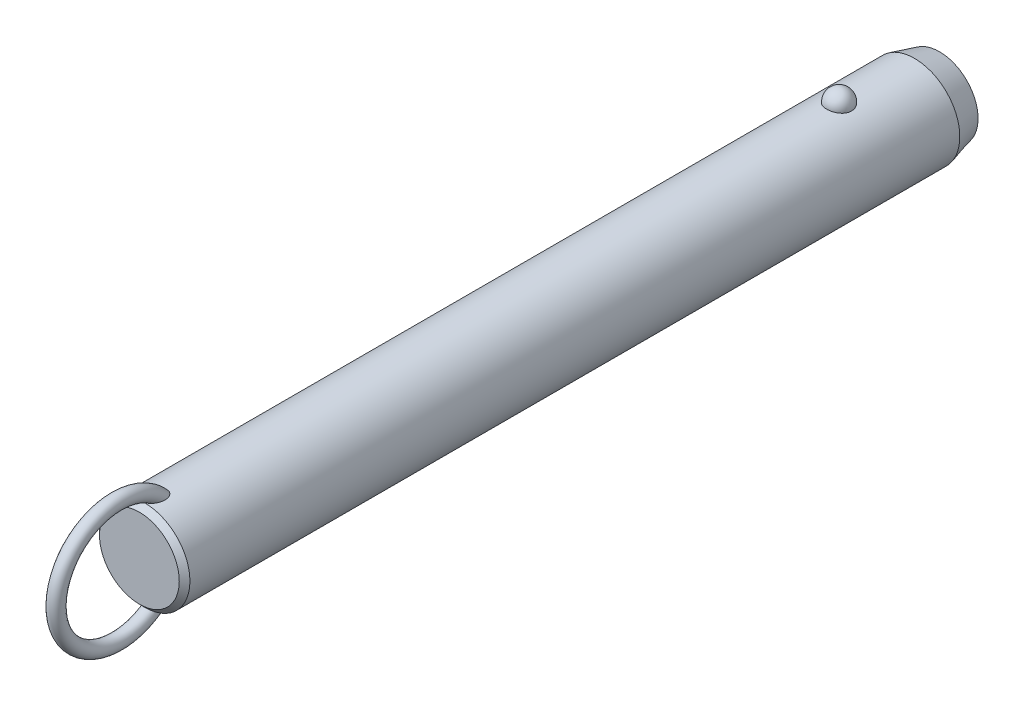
ISO-10303-21;
HEADER;
FILE_DESCRIPTION(('STEP AP214'),'2;1');
FILE_NAME('part.step','',(''),(''),'','','');
FILE_SCHEMA(('AUTOMOTIVE_DESIGN { 1 0 10303 214 1 1 1 1 }'));
ENDSEC;
DATA;
#1=APPLICATION_CONTEXT('core data for automotive mechanical design processes');
#2=APPLICATION_PROTOCOL_DEFINITION('international standard','automotive_design',2000,#1);
#3=PRODUCT_CONTEXT('',#1,'mechanical');
#4=PRODUCT('Part','Part','',(#3));
#5=PRODUCT_RELATED_PRODUCT_CATEGORY('part','',(#4));
#6=PRODUCT_DEFINITION_FORMATION('','',#4);
#7=PRODUCT_DEFINITION_CONTEXT('part definition',#1,'design');
#8=PRODUCT_DEFINITION('design','',#6,#7);
#9=PRODUCT_DEFINITION_SHAPE('','',#8);
#10=(LENGTH_UNIT() NAMED_UNIT(*) SI_UNIT(.MILLI.,.METRE.));
#11=(NAMED_UNIT(*) PLANE_ANGLE_UNIT() SI_UNIT($,.RADIAN.));
#12=(NAMED_UNIT(*) SI_UNIT($,.STERADIAN.) SOLID_ANGLE_UNIT());
#13=UNCERTAINTY_MEASURE_WITH_UNIT(LENGTH_MEASURE(1.E-05),#10,'distance_accuracy_value','');
#14=(GEOMETRIC_REPRESENTATION_CONTEXT(3) GLOBAL_UNCERTAINTY_ASSIGNED_CONTEXT((#13)) GLOBAL_UNIT_ASSIGNED_CONTEXT((#10,
#11,#12)) REPRESENTATION_CONTEXT('',''));
#15=CARTESIAN_POINT('',(0.,0.,0.));
#16=DIRECTION('',(0.,0.,1.));
#17=DIRECTION('',(1.,0.,0.));
#18=AXIS2_PLACEMENT_3D('',#15,#16,#17);
#19=CARTESIAN_POINT('',(0.,0.,180.3));
#20=DIRECTION('',(0.,0.,-1.));
#21=DIRECTION('',(-1.,0.,0.));
#22=AXIS2_PLACEMENT_3D('',#19,#20,#21);
#23=CYLINDRICAL_SURFACE('',#22,12.7);
#24=CARTESIAN_POINT('',(3.46661256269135,12.2177165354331,-3.5));
#25=CARTESIAN_POINT('',(3.4666090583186,12.2177194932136,-3.30432790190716));
#26=CARTESIAN_POINT('',(3.45063567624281,12.2222841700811,-3.10861112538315));
#27=CARTESIAN_POINT('',(3.38712451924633,12.2400345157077,-2.72271899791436));
#28=CARTESIAN_POINT('',(3.33957415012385,12.2532236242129,-2.53254588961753));
#29=CARTESIAN_POINT('',(3.2141234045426,12.286724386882,-2.16324948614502));
#30=CARTESIAN_POINT('',(3.13623639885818,12.3070329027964,-1.98412136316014));
#31=CARTESIAN_POINT('',(2.95205930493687,12.3525018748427,-1.64180592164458));
#32=CARTESIAN_POINT('',(2.84577003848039,12.3776621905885,-1.47861814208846));
#33=CARTESIAN_POINT('',(2.60688050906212,12.4301712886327,-1.17190583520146));
#34=CARTESIAN_POINT('',(2.47415697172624,12.4575299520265,-1.02847897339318));
#35=CARTESIAN_POINT('',(2.18615174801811,12.5112810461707,-0.766177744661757));
#36=CARTESIAN_POINT('',(2.03087002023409,12.5376734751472,-0.647303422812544));
#37=CARTESIAN_POINT('',(1.70237334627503,12.5864761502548,-0.437732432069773));
#38=CARTESIAN_POINT('',(1.52920948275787,12.6088972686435,-0.34695830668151));
#39=CARTESIAN_POINT('',(1.16944170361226,12.6473352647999,-0.195750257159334));
#40=CARTESIAN_POINT('',(0.982839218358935,12.663352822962,-0.135313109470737));
#41=CARTESIAN_POINT('',(0.604961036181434,12.6869706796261,-0.0473241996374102));
#42=CARTESIAN_POINT('',(0.413823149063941,12.6947125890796,-0.0192185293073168));
#43=CARTESIAN_POINT('',(0.0293827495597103,12.7014203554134,0.00517254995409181));
#44=CARTESIAN_POINT('',(-0.163919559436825,12.7003870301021,0.00146092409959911));
#45=CARTESIAN_POINT('',(-0.544374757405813,12.689735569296,-0.0373939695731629));
#46=CARTESIAN_POINT('',(-0.731575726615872,12.6802364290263,-0.0721015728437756));
#47=CARTESIAN_POINT('',(-1.09733277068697,12.6538333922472,-0.171364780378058));
#48=CARTESIAN_POINT('',(-1.27588869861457,12.6369293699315,-0.23592089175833));
#49=CARTESIAN_POINT('',(-1.6204698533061,12.5973946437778,-0.393548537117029));
#50=CARTESIAN_POINT('',(-1.78641865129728,12.5747321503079,-0.48677898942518));
#51=CARTESIAN_POINT('',(-2.10030671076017,12.5261316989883,-0.699110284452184));
#52=CARTESIAN_POINT('',(-2.24824419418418,12.5001934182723,-0.818213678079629));
#53=CARTESIAN_POINT('',(-2.52491489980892,12.4472906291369,-1.08157124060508));
#54=CARTESIAN_POINT('',(-2.65324222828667,12.4203160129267,-1.22624992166));
#55=CARTESIAN_POINT('',(-2.88410007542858,12.3687509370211,-1.53528325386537));
#56=CARTESIAN_POINT('',(-2.98662883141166,12.3441606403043,-1.69963924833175));
#57=CARTESIAN_POINT('',(-3.16432417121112,12.2998199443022,-2.04548497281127));
#58=CARTESIAN_POINT('',(-3.23917525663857,12.2801261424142,-2.22714424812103));
#59=CARTESIAN_POINT('',(-3.35800573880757,12.248167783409,-2.6009138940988));
#60=CARTESIAN_POINT('',(-3.4019860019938,12.2359030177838,-2.79302397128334));
#61=CARTESIAN_POINT('',(-3.45784812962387,12.2202347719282,-3.18140279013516));
#62=CARTESIAN_POINT('',(-3.46986123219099,12.2167950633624,-3.37765118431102));
#63=CARTESIAN_POINT('',(-3.46186273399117,12.2190638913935,-3.76943689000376));
#64=CARTESIAN_POINT('',(-3.44185196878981,12.2247721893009,-3.96497421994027));
#65=CARTESIAN_POINT('',(-3.37048652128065,12.2446381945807,-4.34881728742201));
#66=CARTESIAN_POINT('',(-3.31928253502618,12.2587552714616,-4.53715319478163));
#67=CARTESIAN_POINT('',(-3.18693461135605,12.2938237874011,-4.90231727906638));
#68=CARTESIAN_POINT('',(-3.1057895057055,12.3147754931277,-5.07914500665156));
#69=CARTESIAN_POINT('',(-2.91506431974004,12.3613125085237,-5.4173205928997));
#70=CARTESIAN_POINT('',(-2.80533587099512,12.3869217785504,-5.57858147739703));
#71=CARTESIAN_POINT('',(-2.560414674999,12.4398525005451,-5.88013283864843));
#72=CARTESIAN_POINT('',(-2.42522099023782,12.4671740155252,-6.02042254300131));
#73=CARTESIAN_POINT('',(-2.1323357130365,12.5205965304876,-6.27662798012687));
#74=CARTESIAN_POINT('',(-1.97456596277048,12.5466928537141,-6.39245542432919));
#75=CARTESIAN_POINT('',(-1.64115839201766,12.5946384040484,-6.59583547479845));
#76=CARTESIAN_POINT('',(-1.46552179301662,12.6164879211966,-6.68339001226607));
#77=CARTESIAN_POINT('',(-1.10356050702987,12.6532533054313,-6.82682153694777));
#78=CARTESIAN_POINT('',(-0.917391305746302,12.6682500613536,-6.88306988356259));
#79=CARTESIAN_POINT('',(-0.537836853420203,12.6900288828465,-6.96386887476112));
#80=CARTESIAN_POINT('',(-0.344452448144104,12.6968119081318,-6.9884232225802));
#81=CARTESIAN_POINT('',(0.0402577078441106,12.7013667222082,-7.00496469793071));
#82=CARTESIAN_POINT('',(0.231556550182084,12.6993008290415,-6.99753844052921));
#83=CARTESIAN_POINT('',(0.610105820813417,12.6867505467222,-6.95166366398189));
#84=CARTESIAN_POINT('',(0.797356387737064,12.6762664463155,-6.91321620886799));
#85=CARTESIAN_POINT('',(1.16186657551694,12.6480587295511,-6.80658431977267));
#86=CARTESIAN_POINT('',(1.33915951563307,12.6303611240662,-6.73850666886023));
#87=CARTESIAN_POINT('',(1.67968518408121,12.5896027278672,-6.57450875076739));
#88=CARTESIAN_POINT('',(1.84291705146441,12.5665416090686,-6.47858678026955));
#89=CARTESIAN_POINT('',(2.15340192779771,12.5171072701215,-6.25982455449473));
#90=CARTESIAN_POINT('',(2.30037831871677,12.4906895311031,-6.13660186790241));
#91=CARTESIAN_POINT('',(2.5717412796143,12.4376567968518,-5.86739587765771));
#92=CARTESIAN_POINT('',(2.69612388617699,12.4110417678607,-5.72140858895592));
#93=CARTESIAN_POINT('',(2.92107785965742,12.360051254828,-5.40794137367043));
#94=CARTESIAN_POINT('',(3.02121329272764,12.3357209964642,-5.24014110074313));
#95=CARTESIAN_POINT('',(3.19236291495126,12.2925446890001,-4.8896986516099));
#96=CARTESIAN_POINT('',(3.26338839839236,12.2736965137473,-4.70706226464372));
#97=CARTESIAN_POINT('',(3.36788038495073,12.245404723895,-4.35469510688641));
#98=CARTESIAN_POINT('',(3.40484026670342,12.2351018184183,-4.18605935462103));
#99=CARTESIAN_POINT('',(3.45420764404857,12.2212564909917,-3.84496058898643));
#100=CARTESIAN_POINT('',(3.46661565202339,12.2177139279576,-3.67249765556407));
#101=CARTESIAN_POINT('',(3.46661256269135,12.2177165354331,-3.5));
#102=B_SPLINE_CURVE_WITH_KNOTS('',3,(#24,#25,#26,#27,#28,#29,#30,#31,#32,#33,#34,#35,#36,#37,
#38,#39,#40,#41,#42,#43,#44,#45,#46,#47,#48,#49,#50,#51,#52,#53,#54,#55,#56,#57,#58,#59,#60,#61,
#62,#63,#64,#65,#66,#67,#68,#69,#70,#71,#72,#73,#74,#75,#76,#77,#78,#79,#80,#81,#82,#83,#84,#85,
#86,#87,#88,#89,#90,#91,#92,#93,#94,#95,#96,#97,#98,#99,#100,#101),.UNSPECIFIED.,.T.,.F.,(4,2,2,
2,2,2,2,2,2,2,2,2,2,2,2,2,2,2,2,2,2,2,2,2,2,2,2,2,2,2,2,2,2,2,2,2,2,2,4),(0.,0.586396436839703,
1.17302689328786,1.7593990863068,2.34575431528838,2.93491084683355,3.52406845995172,
4.1115873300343,4.69904375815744,5.2762784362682,5.85345931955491,6.42265312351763,
6.99185659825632,7.56427334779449,8.136746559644,8.71981013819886,9.3029135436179,
9.89247258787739,10.4820150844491,11.0691335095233,11.6562366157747,12.2405256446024,
12.8248374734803,13.412244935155,13.9996740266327,14.5891883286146,15.1786623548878,
15.7609861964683,16.3432419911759,16.914863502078,17.4864654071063,18.056024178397,
18.6256177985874,19.2037609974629,19.7820055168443,20.3699810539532,20.9577282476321,
21.4746855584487,21.9916320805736),.UNSPECIFIED.);
#103=CARTESIAN_POINT('',(3.46661256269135,12.2177165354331,-3.5));
#104=VERTEX_POINT('',#103);
#105=EDGE_CURVE('E41',#104,#104,#102,.T.);
#106=ORIENTED_EDGE('',*,*,#105,.T.);
#107=EDGE_LOOP('',(#106));
#108=FACE_BOUND('',#107,.T.);
#109=CARTESIAN_POINT('',(0.,0.,191.5));
#110=DIRECTION('',(0.,0.,1.));
#111=DIRECTION('',(1.,0.,0.));
#112=AXIS2_PLACEMENT_3D('',#109,#110,#111);
#113=CIRCLE('',#112,12.7);
#114=CARTESIAN_POINT('',(12.7,0.,191.5));
#115=VERTEX_POINT('',#114);
#116=EDGE_CURVE('E10',#115,#115,#113,.F.);
#117=ORIENTED_EDGE('',*,*,#116,.T.);
#118=EDGE_LOOP('',(#117));
#119=FACE_BOUND('',#118,.T.);
#120=CARTESIAN_POINT('',(-0.548122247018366,-12.6881662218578,185.243218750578));
#121=CARTESIAN_POINT('',(-0.648865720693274,-12.6838128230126,185.277926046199));
#122=CARTESIAN_POINT('',(-0.746398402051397,-12.6783867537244,185.322042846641));
#123=CARTESIAN_POINT('',(-0.932125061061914,-12.666091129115,185.426764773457));
#124=CARTESIAN_POINT('',(-1.02030388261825,-12.6592192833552,185.487396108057));
#125=CARTESIAN_POINT('',(-1.18487740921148,-12.6448747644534,185.621847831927));
#126=CARTESIAN_POINT('',(-1.26134296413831,-12.637406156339,185.695582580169));
#127=CARTESIAN_POINT('',(-1.4023120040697,-12.6225412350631,185.853604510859));
#128=CARTESIAN_POINT('',(-1.46681470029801,-12.6151449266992,185.93789238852));
#129=CARTESIAN_POINT('',(-1.60714786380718,-12.5981718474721,186.149657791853));
#130=CARTESIAN_POINT('',(-1.67725126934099,-12.588900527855,186.280962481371));
#131=CARTESIAN_POINT('',(-1.79536591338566,-12.5725964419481,186.553247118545));
#132=CARTESIAN_POINT('',(-1.84333535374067,-12.5655679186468,186.694244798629));
#133=CARTESIAN_POINT('',(-1.93422576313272,-12.5519624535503,187.037645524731));
#134=CARTESIAN_POINT('',(-1.96788773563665,-12.5466298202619,187.242557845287));
#135=CARTESIAN_POINT('',(-1.9941399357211,-12.542463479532,187.551760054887));
#136=CARTESIAN_POINT('',(-1.99883864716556,-12.5417153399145,187.655298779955));
#137=CARTESIAN_POINT('',(-2.00078003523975,-12.5414074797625,187.86245124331));
#138=CARTESIAN_POINT('',(-1.99802449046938,-12.5418474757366,187.966064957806));
#139=CARTESIAN_POINT('',(-1.98336733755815,-12.5441750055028,188.21032076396));
#140=CARTESIAN_POINT('',(-1.96851430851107,-12.5465291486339,188.350780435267));
#141=CARTESIAN_POINT('',(-1.92707089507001,-12.5529612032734,188.629960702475));
#142=CARTESIAN_POINT('',(-1.90047458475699,-12.5570399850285,188.768680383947));
#143=CARTESIAN_POINT('',(-1.83619120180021,-12.5666008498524,189.04341135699));
#144=CARTESIAN_POINT('',(-1.79850828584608,-12.57208240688,189.179423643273));
#145=CARTESIAN_POINT('',(-1.71223796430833,-12.5841228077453,189.447842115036));
#146=CARTESIAN_POINT('',(-1.66365679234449,-12.5906810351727,189.580250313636));
#147=CARTESIAN_POINT('',(-1.57804503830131,-12.6016176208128,189.78548877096));
#148=CARTESIAN_POINT('',(-1.54477252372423,-12.6057501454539,189.859914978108));
#149=CARTESIAN_POINT('',(-1.47424480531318,-12.6141930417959,190.006839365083));
#150=CARTESIAN_POINT('',(-1.43699041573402,-12.6185033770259,190.079337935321));
#151=CARTESIAN_POINT('',(-1.35825795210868,-12.6272207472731,190.221892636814));
#152=CARTESIAN_POINT('',(-1.31678520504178,-12.6316276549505,190.291951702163));
#153=CARTESIAN_POINT('',(-1.22917793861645,-12.6404532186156,190.429070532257));
#154=CARTESIAN_POINT('',(-1.18304514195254,-12.6448718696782,190.496131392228));
#155=CARTESIAN_POINT('',(-1.07246411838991,-12.6547893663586,190.643874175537));
#156=CARTESIAN_POINT('',(-1.0064223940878,-12.6602600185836,190.723384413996));
#157=CARTESIAN_POINT('',(-0.864441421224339,-12.6707460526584,190.873169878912));
#158=CARTESIAN_POINT('',(-0.788516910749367,-12.6757620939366,190.943458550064));
#159=CARTESIAN_POINT('',(-0.652215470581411,-12.6833591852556,191.048680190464));
#160=CARTESIAN_POINT('',(-0.594982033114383,-12.6861973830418,191.087624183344));
#161=CARTESIAN_POINT('',(-0.475269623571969,-12.6912445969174,191.156489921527));
#162=CARTESIAN_POINT('',(-0.412800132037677,-12.6934547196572,191.186427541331));
#163=CARTESIAN_POINT('',(-0.295749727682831,-12.6966636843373,191.229756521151));
#164=CARTESIAN_POINT('',(-0.241949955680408,-12.6978134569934,191.245218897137));
#165=CARTESIAN_POINT('',(-0.132508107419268,-12.6994261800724,191.266884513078));
#166=CARTESIAN_POINT('',(-0.0768679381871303,-12.6998898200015,191.273097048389));
#167=CARTESIAN_POINT('',(0.0347696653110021,-12.7000752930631,191.275583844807));
#168=CARTESIAN_POINT('',(0.0907676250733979,-12.6997954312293,191.271835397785));
#169=CARTESIAN_POINT('',(0.201283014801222,-12.6985255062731,191.254788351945));
#170=CARTESIAN_POINT('',(0.255799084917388,-12.6975348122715,191.241481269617));
#171=CARTESIAN_POINT('',(0.376042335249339,-12.6946091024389,191.20203792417));
#172=CARTESIAN_POINT('',(0.440950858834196,-12.6924943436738,191.173449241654));
#173=CARTESIAN_POINT('',(0.565350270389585,-12.6875639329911,191.106323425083));
#174=CARTESIAN_POINT('',(0.624828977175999,-12.6847467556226,191.067764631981));
#175=CARTESIAN_POINT('',(0.774116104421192,-12.6767252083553,190.956949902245));
#176=CARTESIAN_POINT('',(0.859449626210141,-12.6711344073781,190.878760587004));
#177=CARTESIAN_POINT('',(1.01789440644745,-12.6593922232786,190.710943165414));
#178=CARTESIAN_POINT('',(1.09096902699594,-12.653239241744,190.621282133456));
#179=CARTESIAN_POINT('',(1.22268793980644,-12.6411674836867,190.440265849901));
#180=CARTESIAN_POINT('',(1.28193986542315,-12.6352572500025,190.349345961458));
#181=CARTESIAN_POINT('',(1.39259777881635,-12.6235401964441,190.162792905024));
#182=CARTESIAN_POINT('',(1.44399707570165,-12.6177334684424,190.067155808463));
#183=CARTESIAN_POINT('',(1.53972870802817,-12.6064093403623,189.872273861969));
#184=CARTESIAN_POINT('',(1.58405262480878,-12.6008922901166,189.773024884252));
#185=CARTESIAN_POINT('',(1.66600705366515,-12.5903187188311,189.571772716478));
#186=CARTESIAN_POINT('',(1.70363651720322,-12.5852622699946,189.469769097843));
#187=CARTESIAN_POINT('',(1.7754537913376,-12.5753406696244,189.254358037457));
#188=CARTESIAN_POINT('',(1.80903453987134,-12.5705328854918,189.140745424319));
#189=CARTESIAN_POINT('',(1.86844163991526,-12.5618400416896,188.911457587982));
#190=CARTESIAN_POINT('',(1.89426665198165,-12.5579551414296,188.795782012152));
#191=CARTESIAN_POINT('',(1.93785464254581,-12.5513030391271,188.563007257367));
#192=CARTESIAN_POINT('',(1.95562640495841,-12.5485346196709,188.445909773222));
#193=CARTESIAN_POINT('',(1.98264463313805,-12.5442934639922,188.210747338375));
#194=CARTESIAN_POINT('',(1.99189298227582,-12.5428204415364,188.09268260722));
#195=CARTESIAN_POINT('',(2.00416068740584,-12.540871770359,187.780622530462));
#196=CARTESIAN_POINT('',(1.99944433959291,-12.541631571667,187.586229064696));
#197=CARTESIAN_POINT('',(1.9611375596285,-12.5476846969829,187.200309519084));
#198=CARTESIAN_POINT('',(1.92758341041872,-12.5529723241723,187.008780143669));
#199=CARTESIAN_POINT('',(1.83934342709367,-12.5661532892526,186.682272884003));
#200=CARTESIAN_POINT('',(1.7921544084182,-12.5730485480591,186.54524997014));
#201=CARTESIAN_POINT('',(1.67676242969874,-12.588958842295,186.280445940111));
#202=CARTESIAN_POINT('',(1.60859050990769,-12.597970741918,186.152651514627));
#203=CARTESIAN_POINT('',(1.46583832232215,-12.6152829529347,185.935800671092));
#204=CARTESIAN_POINT('',(1.39525727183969,-12.6233659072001,185.84410500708));
#205=CARTESIAN_POINT('',(1.23992594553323,-12.6395676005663,185.673485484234));
#206=CARTESIAN_POINT('',(1.15517932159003,-12.6476863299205,185.594558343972));
#207=CARTESIAN_POINT('',(0.971995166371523,-12.6630846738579,185.452643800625));
#208=CARTESIAN_POINT('',(0.873456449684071,-12.6703572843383,185.389784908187));
#209=CARTESIAN_POINT('',(0.665847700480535,-12.6829569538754,185.284487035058));
#210=CARTESIAN_POINT('',(0.556784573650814,-12.688285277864,185.242034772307));
#211=CARTESIAN_POINT('',(0.347338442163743,-12.6956226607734,185.184443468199));
#212=CARTESIAN_POINT('',(0.247759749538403,-12.6979816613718,185.166399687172));
#213=CARTESIAN_POINT('',(0.0470218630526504,-12.7003077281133,185.148600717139));
#214=CARTESIAN_POINT('',(-0.0541350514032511,-12.7002779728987,185.148821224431));
#215=CARTESIAN_POINT('',(-0.221414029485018,-12.6982482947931,185.164363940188));
#216=CARTESIAN_POINT('',(-0.288055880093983,-12.6969033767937,185.174666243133));
#217=CARTESIAN_POINT('',(-0.419599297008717,-12.6932369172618,185.20313489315));
#218=CARTESIAN_POINT('',(-0.484501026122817,-12.6909154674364,185.221300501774));
#219=CARTESIAN_POINT('',(-0.548122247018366,-12.6881662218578,185.243218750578));
#220=B_SPLINE_CURVE_WITH_KNOTS('',3,(#120,#121,#122,#123,#124,#125,#126,#127,#128,#129,#130,
#131,#132,#133,#134,#135,#136,#137,#138,#139,#140,#141,#142,#143,#144,#145,#146,#147,#148,#149,
#150,#151,#152,#153,#154,#155,#156,#157,#158,#159,#160,#161,#162,#163,#164,#165,#166,#167,#168,
#169,#170,#171,#172,#173,#174,#175,#176,#177,#178,#179,#180,#181,#182,#183,#184,#185,#186,#187,
#188,#189,#190,#191,#192,#193,#194,#195,#196,#197,#198,#199,#200,#201,#202,#203,#204,#205,#206,
#207,#208,#209,#210,#211,#212,#213,#214,#215,#216,#217,#218,#219),.UNSPECIFIED.,.T.,.F.,(4,2,2,
2,2,2,2,2,2,2,2,2,2,2,2,2,2,2,2,2,2,2,2,2,2,2,2,2,2,2,2,2,2,2,2,2,2,2,2,2,2,2,2,2,2,2,2,2,2,4),
(0.,0.31964225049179,0.639794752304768,0.957927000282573,1.27608021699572,1.72100165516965,
2.16675988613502,2.78630021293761,3.09705782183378,3.40774128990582,3.8309635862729,
4.25439969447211,4.67767724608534,5.10071330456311,5.34550297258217,5.59024267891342,
5.83467707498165,6.07902143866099,6.38891080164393,6.69834321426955,6.9056091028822,
7.11250749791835,7.27977315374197,7.44687060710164,7.61434932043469,7.78197685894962,
7.99365544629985,8.20579780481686,8.55147335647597,8.89816429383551,9.22375138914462,
9.54961437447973,9.87586224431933,10.202161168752,10.5575872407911,10.9130746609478,
11.2681734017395,11.6231936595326,12.2046601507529,12.7853961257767,13.2191642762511,
13.6522938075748,13.9989174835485,14.3454519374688,14.6946768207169,15.0436740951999,
15.3457513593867,15.647426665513,15.8493051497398,16.0511646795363),.UNSPECIFIED.);
#221=CARTESIAN_POINT('',(-0.548122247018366,-12.6881662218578,185.243218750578));
#222=VERTEX_POINT('',#221);
#223=EDGE_CURVE('E59',#222,#222,#220,.T.);
#224=ORIENTED_EDGE('',*,*,#223,.T.);
#225=EDGE_LOOP('',(#224));
#226=FACE_BOUND('',#225,.T.);
#227=CARTESIAN_POINT('',(-0.548122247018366,12.6881662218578,185.243218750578));
#228=CARTESIAN_POINT('',(-0.45943607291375,12.6919968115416,185.212673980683));
#229=CARTESIAN_POINT('',(-0.36818946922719,12.6949996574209,185.189391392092));
#230=CARTESIAN_POINT('',(-0.183024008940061,12.6990186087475,185.158406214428));
#231=CARTESIAN_POINT('',(-0.0891049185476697,12.7000345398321,185.150704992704));
#232=CARTESIAN_POINT('',(0.0987147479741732,12.6999636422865,185.151245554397));
#233=CARTESIAN_POINT('',(0.192615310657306,12.6988761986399,185.159492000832));
#234=CARTESIAN_POINT('',(0.377658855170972,12.6947211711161,185.191551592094));
#235=CARTESIAN_POINT('',(0.468801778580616,12.6916535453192,185.215365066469));
#236=CARTESIAN_POINT('',(0.645809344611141,12.6838788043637,185.27745651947));
#237=CARTESIAN_POINT('',(0.731679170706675,12.6791733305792,185.315720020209));
#238=CARTESIAN_POINT('',(0.896315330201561,12.6686004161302,185.405120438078));
#239=CARTESIAN_POINT('',(0.975080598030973,12.6627328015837,185.456259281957));
#240=CARTESIAN_POINT('',(1.12963655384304,12.6499161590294,185.57367820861));
#241=CARTESIAN_POINT('',(1.20478673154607,12.6429194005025,185.640792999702));
#242=CARTESIAN_POINT('',(1.34448241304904,12.6288282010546,185.78522507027));
#243=CARTESIAN_POINT('',(1.40902173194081,12.621733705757,185.862548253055));
#244=CARTESIAN_POINT('',(1.55208211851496,12.6050877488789,186.059247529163));
#245=CARTESIAN_POINT('',(1.62510490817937,12.5957546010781,186.182654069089));
#246=CARTESIAN_POINT('',(1.7501904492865,12.5789823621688,186.439769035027));
#247=CARTESIAN_POINT('',(1.80221377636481,12.5715468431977,186.573496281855));
#248=CARTESIAN_POINT('',(1.90309965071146,12.5567434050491,186.898351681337));
#249=CARTESIAN_POINT('',(1.94342317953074,12.5504515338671,187.092161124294));
#250=CARTESIAN_POINT('',(1.99332997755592,12.5426147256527,187.48378810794));
#251=CARTESIAN_POINT('',(2.00285305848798,12.5410790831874,187.681612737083));
#252=CARTESIAN_POINT('',(1.99678999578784,12.5420407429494,188.016642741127));
#253=CARTESIAN_POINT('',(1.98794117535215,12.5434564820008,188.154042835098));
#254=CARTESIAN_POINT('',(1.95865119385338,12.5480641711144,188.427639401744));
#255=CARTESIAN_POINT('',(1.93820436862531,12.5512569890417,188.563835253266));
#256=CARTESIAN_POINT('',(1.88647896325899,12.5591352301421,188.834249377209));
#257=CARTESIAN_POINT('',(1.85518800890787,12.5638223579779,188.968465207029));
#258=CARTESIAN_POINT('',(1.78217886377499,12.5743868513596,189.233936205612));
#259=CARTESIAN_POINT('',(1.74046509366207,12.5802637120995,189.365192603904));
#260=CARTESIAN_POINT('',(1.66024095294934,12.5910571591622,189.586085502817));
#261=CARTESIAN_POINT('',(1.62434772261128,12.5957535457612,189.676690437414));
#262=CARTESIAN_POINT('',(1.54709009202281,12.6054762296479,189.855512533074));
#263=CARTESIAN_POINT('',(1.50572681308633,12.6105024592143,189.943730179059));
#264=CARTESIAN_POINT('',(1.41728020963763,12.620748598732,190.116932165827));
#265=CARTESIAN_POINT('',(1.37021377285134,12.625967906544,190.201925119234));
#266=CARTESIAN_POINT('',(1.26969620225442,12.6364721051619,190.368007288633));
#267=CARTESIAN_POINT('',(1.21624929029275,12.6417569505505,190.449099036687));
#268=CARTESIAN_POINT('',(1.10304413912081,12.6521331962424,190.604702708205));
#269=CARTESIAN_POINT('',(1.04340936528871,12.657226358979,190.679303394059));
#270=CARTESIAN_POINT('',(0.915919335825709,12.667090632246,190.821324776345));
#271=CARTESIAN_POINT('',(0.848064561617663,12.6718617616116,190.88874589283));
#272=CARTESIAN_POINT('',(0.717035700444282,12.67987711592,191.000624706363));
#273=CARTESIAN_POINT('',(0.655526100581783,12.6832377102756,191.046997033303));
#274=CARTESIAN_POINT('',(0.525985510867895,12.6892676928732,191.129619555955));
#275=CARTESIAN_POINT('',(0.45796984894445,12.6919386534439,191.165892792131));
#276=CARTESIAN_POINT('',(0.334859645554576,12.695691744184,191.216657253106));
#277=CARTESIAN_POINT('',(0.28111658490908,12.6970073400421,191.234373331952));
#278=CARTESIAN_POINT('',(0.171425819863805,12.6989609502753,191.260642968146));
#279=CARTESIAN_POINT('',(0.115480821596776,12.699599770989,191.269207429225));
#280=CARTESIAN_POINT('',(0.00272618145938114,12.7001251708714,191.276253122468));
#281=CARTESIAN_POINT('',(-0.0540859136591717,12.7000089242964,191.274696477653));
#282=CARTESIAN_POINT('',(-0.166544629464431,12.6990328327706,191.261600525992));
#283=CARTESIAN_POINT('',(-0.222190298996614,12.6981724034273,191.250053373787));
#284=CARTESIAN_POINT('',(-0.342018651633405,12.695562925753,191.214912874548));
#285=CARTESIAN_POINT('',(-0.405606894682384,12.6936676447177,191.18933225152));
#286=CARTESIAN_POINT('',(-0.527815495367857,12.6891754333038,191.128311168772));
#287=CARTESIAN_POINT('',(-0.58642538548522,12.6865770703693,191.092850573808));
#288=CARTESIAN_POINT('',(-0.731842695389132,12.6792129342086,190.991496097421));
#289=CARTESIAN_POINT('',(-0.814709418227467,12.6740767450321,190.9200395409));
#290=CARTESIAN_POINT('',(-0.969101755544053,12.6632083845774,190.76589007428));
#291=CARTESIAN_POINT('',(-1.0405956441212,12.6574746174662,190.683166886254));
#292=CARTESIAN_POINT('',(-1.16981116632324,12.6461638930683,190.515809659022));
#293=CARTESIAN_POINT('',(-1.22811369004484,12.6405994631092,190.431616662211));
#294=CARTESIAN_POINT('',(-1.33743405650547,12.6295007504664,190.258579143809));
#295=CARTESIAN_POINT('',(-1.38844577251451,12.6239664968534,190.169730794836));
#296=CARTESIAN_POINT('',(-1.48400702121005,12.6130898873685,189.988389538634));
#297=CARTESIAN_POINT('',(-1.52854232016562,12.6077479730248,189.895889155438));
#298=CARTESIAN_POINT('',(-1.61150113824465,12.5974127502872,189.708160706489));
#299=CARTESIAN_POINT('',(-1.64992317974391,12.5924195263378,189.612931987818));
#300=CARTESIAN_POINT('',(-1.73468589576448,12.581070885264,189.38289362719));
#301=CARTESIAN_POINT('',(-1.77831261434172,12.5749388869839,189.247066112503));
#302=CARTESIAN_POINT('',(-1.85439734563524,12.5639437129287,188.972212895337));
#303=CARTESIAN_POINT('',(-1.88684994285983,12.5590811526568,188.833185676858));
#304=CARTESIAN_POINT('',(-1.94008483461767,12.550968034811,188.55309235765));
#305=CARTESIAN_POINT('',(-1.96088706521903,12.5477147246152,188.412030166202));
#306=CARTESIAN_POINT('',(-1.99000539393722,12.5431291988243,188.128668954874));
#307=CARTESIAN_POINT('',(-1.99832911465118,12.5417958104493,187.986370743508));
#308=CARTESIAN_POINT('',(-2.00166624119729,12.5412674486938,187.657627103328));
#309=CARTESIAN_POINT('',(-1.99178843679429,12.5428579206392,187.471088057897));
#310=CARTESIAN_POINT('',(-1.94455183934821,12.5502731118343,187.10162404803));
#311=CARTESIAN_POINT('',(-1.9072403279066,12.5560905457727,186.918693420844));
#312=CARTESIAN_POINT('',(-1.81330718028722,12.5699462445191,186.604848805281));
#313=CARTESIAN_POINT('',(-1.76338820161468,12.5771273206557,186.471910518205));
#314=CARTESIAN_POINT('',(-1.64305018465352,12.593414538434,186.215681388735));
#315=CARTESIAN_POINT('',(-1.57265346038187,12.6025185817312,186.092380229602));
#316=CARTESIAN_POINT('',(-1.4263495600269,12.6198178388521,185.883564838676));
#317=CARTESIAN_POINT('',(-1.35423772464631,12.6278405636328,185.795384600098));
#318=CARTESIAN_POINT('',(-1.19645664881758,12.6437632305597,185.632107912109));
#319=CARTESIAN_POINT('',(-1.11080536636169,12.6516633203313,185.556994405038));
#320=CARTESIAN_POINT('',(-0.947219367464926,12.6648319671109,185.437811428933));
#321=CARTESIAN_POINT('',(-0.871624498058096,12.670300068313,185.390541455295));
#322=CARTESIAN_POINT('',(-0.714161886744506,12.6801492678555,185.3077413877));
#323=CARTESIAN_POINT('',(-0.632295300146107,12.684530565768,185.27220913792));
#324=CARTESIAN_POINT('',(-0.548122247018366,12.6881662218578,185.243218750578));
#325=B_SPLINE_CURVE_WITH_KNOTS('',3,(#227,#228,#229,#230,#231,#232,#233,#234,#235,#236,#237,
#238,#239,#240,#241,#242,#243,#244,#245,#246,#247,#248,#249,#250,#251,#252,#253,#254,#255,#256,
#257,#258,#259,#260,#261,#262,#263,#264,#265,#266,#267,#268,#269,#270,#271,#272,#273,#274,#275,
#276,#277,#278,#279,#280,#281,#282,#283,#284,#285,#286,#287,#288,#289,#290,#291,#292,#293,#294,
#295,#296,#297,#298,#299,#300,#301,#302,#303,#304,#305,#306,#307,#308,#309,#310,#311,#312,#313,
#314,#315,#316,#317,#318,#319,#320,#321,#322,#323,#324),.UNSPECIFIED.,.T.,.F.,(4,2,2,2,2,2,2,2,
2,2,2,2,2,2,2,2,2,2,2,2,2,2,2,2,2,2,2,2,2,2,2,2,2,2,2,2,2,2,2,2,2,2,2,2,2,2,2,2,4),(0.,
0.281328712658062,0.562682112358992,0.844117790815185,1.12555942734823,1.40671982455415,
1.68792232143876,1.98972294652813,2.29169886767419,2.72039860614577,3.14989948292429,
3.74084916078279,4.33295293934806,4.74554109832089,5.15833092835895,5.57159335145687,
5.98468079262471,6.27722775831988,6.56971484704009,6.86135609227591,7.15280542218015,
7.43927407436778,7.72572595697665,7.95635862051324,8.18646071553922,8.35559393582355,
8.52452541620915,8.6940894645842,8.86378678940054,9.06834348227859,9.27332014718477,
9.60010414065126,9.9277843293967,10.2350252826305,10.5425229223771,10.8506864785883,
11.1589244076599,11.5867893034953,12.0148612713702,12.4421984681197,12.8692745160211,
13.4279365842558,13.9856380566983,14.4107062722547,14.8353130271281,15.1765567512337,
15.517351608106,15.7844129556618,16.051425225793),.UNSPECIFIED.);
#326=CARTESIAN_POINT('',(-0.548122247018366,12.6881662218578,185.243218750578));
#327=VERTEX_POINT('',#326);
#328=EDGE_CURVE('E66',#327,#327,#325,.T.);
#329=ORIENTED_EDGE('',*,*,#328,.T.);
#330=EDGE_LOOP('',(#329));
#331=FACE_BOUND('',#330,.T.);
#332=CARTESIAN_POINT('',(0.,0.,-24.6999999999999));
#333=DIRECTION('',(0.,0.,-1.));
#334=DIRECTION('',(-1.,0.,0.));
#335=AXIS2_PLACEMENT_3D('',#332,#333,#334);
#336=CIRCLE('',#335,12.7);
#337=CARTESIAN_POINT('',(-12.7,0.,-24.6999999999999));
#338=VERTEX_POINT('',#337);
#339=EDGE_CURVE('E56',#338,#338,#336,.F.);
#340=ORIENTED_EDGE('',*,*,#339,.T.);
#341=EDGE_LOOP('',(#340));
#342=FACE_BOUND('',#341,.T.);
#343=ADVANCED_FACE('F37',(#108,#119,#226,#331,#342),#23,.T.);
#344=CARTESIAN_POINT('',(0.,0.,-31.7));
#345=DIRECTION('',(0.,0.,-1.));
#346=DIRECTION('',(-1.,0.,0.));
#347=AXIS2_PLACEMENT_3D('',#344,#345,#346);
#348=PLANE('',#347);
#349=CARTESIAN_POINT('',(0.,0.,-31.7));
#350=DIRECTION('',(0.,0.,-1.));
#351=DIRECTION('',(-1.,0.,0.));
#352=AXIS2_PLACEMENT_3D('',#349,#350,#351);
#353=CIRCLE('',#352,10.8243556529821);
#354=CARTESIAN_POINT('',(-10.8243556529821,0.,-31.7));
#355=VERTEX_POINT('',#354);
#356=EDGE_CURVE('E65',#355,#355,#353,.T.);
#357=ORIENTED_EDGE('',*,*,#356,.T.);
#358=EDGE_LOOP('',(#357));
#359=FACE_BOUND('',#358,.T.);
#360=ADVANCED_FACE('F84',(#359),#348,.T.);
#361=CARTESIAN_POINT('',(0.,0.,-31.7));
#362=DIRECTION('',(0.,0.,1.));
#363=DIRECTION('',(1.,0.,0.));
#364=AXIS2_PLACEMENT_3D('',#361,#362,#363);
#365=CONICAL_SURFACE('',#364,10.8243556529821,0.261799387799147);
#366=ORIENTED_EDGE('',*,*,#339,.F.);
#367=EDGE_LOOP('',(#366));
#368=FACE_BOUND('',#367,.T.);
#369=ORIENTED_EDGE('',*,*,#356,.F.);
#370=EDGE_LOOP('',(#369));
#371=FACE_BOUND('',#370,.T.);
#372=ADVANCED_FACE('F82',(#368,#371),#365,.T.);
#373=CARTESIAN_POINT('',(0.,0.,193.));
#374=DIRECTION('',(0.,0.,1.));
#375=DIRECTION('',(1.,0.,0.));
#376=AXIS2_PLACEMENT_3D('',#373,#374,#375);
#377=PLANE('',#376);
#378=CARTESIAN_POINT('',(0.,0.,193.));
#379=DIRECTION('',(0.,0.,1.));
#380=DIRECTION('',(1.,0.,0.));
#381=AXIS2_PLACEMENT_3D('',#378,#379,#380);
#382=CIRCLE('',#381,11.2);
#383=CARTESIAN_POINT('',(11.2,0.,193.));
#384=VERTEX_POINT('',#383);
#385=EDGE_CURVE('E50',#384,#384,#382,.T.);
#386=ORIENTED_EDGE('',*,*,#385,.T.);
#387=EDGE_LOOP('',(#386));
#388=FACE_BOUND('',#387,.T.);
#389=ADVANCED_FACE('F76',(#388),#377,.T.);
#390=CARTESIAN_POINT('',(0.,0.,199.35));
#391=DIRECTION('',(1.,0.,0.));
#392=DIRECTION('',(0.,0.,-1.));
#393=AXIS2_PLACEMENT_3D('',#390,#391,#392);
#394=TOROIDAL_SURFACE('',#393,17.05,2.);
#395=ORIENTED_EDGE('',*,*,#328,.F.);
#396=EDGE_LOOP('',(#395));
#397=FACE_BOUND('',#396,.T.);
#398=ORIENTED_EDGE('',*,*,#223,.F.);
#399=EDGE_LOOP('',(#398));
#400=FACE_BOUND('',#399,.T.);
#401=ADVANCED_FACE('F72',(#397,#400),#394,.T.);
#402=CARTESIAN_POINT('',(0.,0.,193.));
#403=DIRECTION('',(0.,0.,-1.));
#404=DIRECTION('',(-1.,0.,0.));
#405=AXIS2_PLACEMENT_3D('',#402,#403,#404);
#406=CONICAL_SURFACE('',#405,11.2,0.785398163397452);
#407=ORIENTED_EDGE('',*,*,#116,.F.);
#408=EDGE_LOOP('',(#407));
#409=FACE_BOUND('',#408,.T.);
#410=ORIENTED_EDGE('',*,*,#385,.F.);
#411=EDGE_LOOP('',(#410));
#412=FACE_BOUND('',#411,.T.);
#413=ADVANCED_FACE('F39',(#409,#412),#406,.T.);
#414=CARTESIAN_POINT('',(0.,12.7,-3.5));
#415=DIRECTION('',(0.,1.,0.));
#416=DIRECTION('',(0.,0.,1.));
#417=AXIS2_PLACEMENT_3D('',#414,#415,#416);
#418=SPHERICAL_SURFACE('',#417,3.5);
#419=ORIENTED_EDGE('',*,*,#105,.F.);
#420=EDGE_LOOP('',(#419));
#421=FACE_BOUND('',#420,.T.);
#422=ADVANCED_FACE('F78',(#421),#418,.T.);
#423=CLOSED_SHELL('',(#343,#360,#372,#389,#401,#413,#422));
#424=MANIFOLD_SOLID_BREP('B2',#423);
#425=ADVANCED_BREP_SHAPE_REPRESENTATION('',(#18,#424),#14);
#426=SHAPE_DEFINITION_REPRESENTATION(#9,#425);
ENDSEC;
END-ISO-10303-21;
